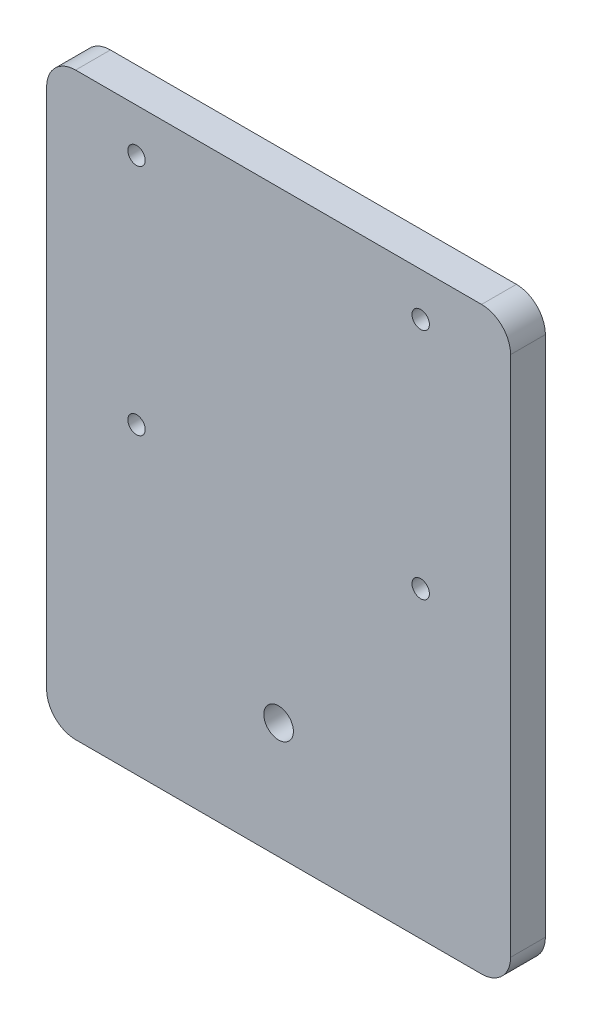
from build123d import *

# Parameters (mm, degrees)
SKETCH1_W           = 80
SKETCH1_H           = 100
BOSS_EXTRUDE1_DEPTH = 6
FILLET1_R           = 5
SKETCH2_R           = 2.55
CUT_EXTRUDE1_DEPTH  = 6
SKETCH5_R           = 1.5
CUT_EXTRUDE2_DEPTH  = 10


with BuildPart() as part:
    # Sketch1 → Boss-Extrude1 (new body)
    with BuildSketch(Plane.XY):
        Rectangle(SKETCH1_W, SKETCH1_H)
    extrude(amount=BOSS_EXTRUDE1_DEPTH)

    # Fillet1
    fillet1_edges = [part.edges().sort_by_distance(p)[0] for p in [
        (40, -50, 3),
        (-40, -50, 3),
        (-40, 50, 3),
        (40, 50, 3),
    ]]
    fillet(fillet1_edges, radius=FILLET1_R)

    # Sketch2 → Cut-Extrude1 (cut)
    with BuildSketch(Plane.XY.offset(6)):
        with Locations((0, -30)):
            Circle(SKETCH2_R)
    extrude(amount=-CUT_EXTRUDE1_DEPTH, mode=Mode.SUBTRACT)

    # Sketch5 → Cut-Extrude2 (cut)
    with BuildSketch(Plane(origin=(0, 0, 0), x_dir=(-1, 0, 0), z_dir=(0, 0, -1))):
        with Locations((24.5, 2.298811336)):
            Circle(SKETCH5_R)
        with Locations((24.5, 42.501188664)):
            Circle(SKETCH5_R)
        with Locations((-24.5, 2.298811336)):
            Circle(SKETCH5_R)
        with Locations((-24.5, 42.501188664)):
            Circle(SKETCH5_R)
    extrude(amount=-CUT_EXTRUDE2_DEPTH, mode=Mode.SUBTRACT)


solid = part.part
